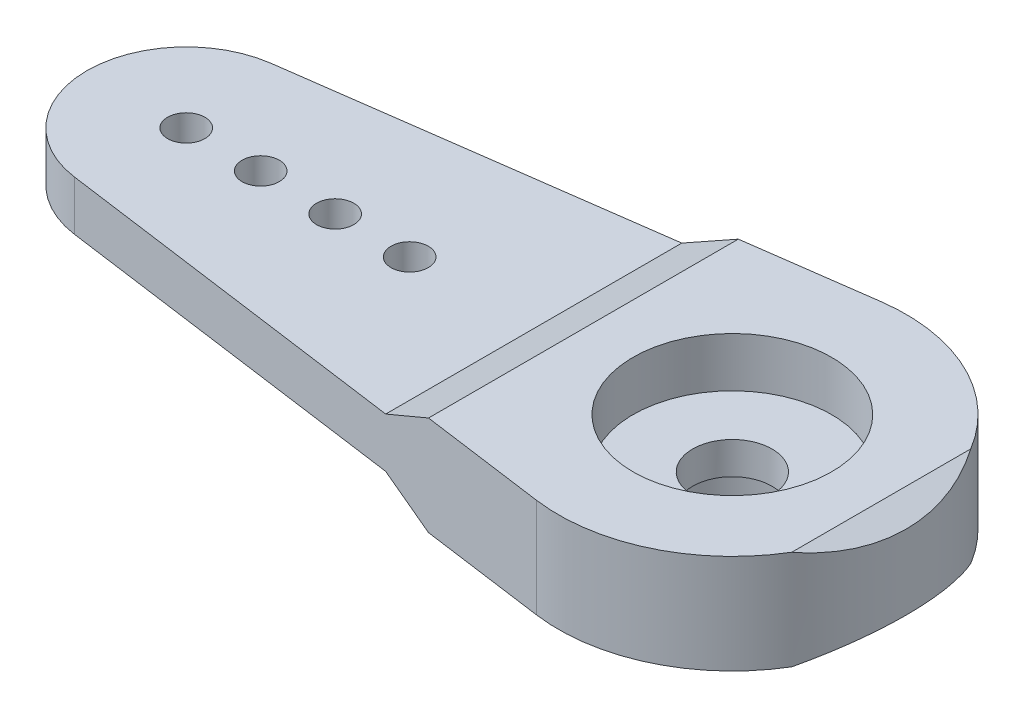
ISO-10303-21;
HEADER;
FILE_DESCRIPTION(('STEP AP214'),'2;1');
FILE_NAME('part.step','',(''),(''),'','','');
FILE_SCHEMA(('AUTOMOTIVE_DESIGN { 1 0 10303 214 1 1 1 1 }'));
ENDSEC;
DATA;
#1=APPLICATION_CONTEXT('core data for automotive mechanical design processes');
#2=APPLICATION_PROTOCOL_DEFINITION('international standard','automotive_design',2000,#1);
#3=PRODUCT_CONTEXT('',#1,'mechanical');
#4=PRODUCT('Part','Part','',(#3));
#5=PRODUCT_RELATED_PRODUCT_CATEGORY('part','',(#4));
#6=PRODUCT_DEFINITION_FORMATION('','',#4);
#7=PRODUCT_DEFINITION_CONTEXT('part definition',#1,'design');
#8=PRODUCT_DEFINITION('design','',#6,#7);
#9=PRODUCT_DEFINITION_SHAPE('','',#8);
#10=(LENGTH_UNIT() NAMED_UNIT(*) SI_UNIT(.MILLI.,.METRE.));
#11=(NAMED_UNIT(*) PLANE_ANGLE_UNIT() SI_UNIT($,.RADIAN.));
#12=(NAMED_UNIT(*) SI_UNIT($,.STERADIAN.) SOLID_ANGLE_UNIT());
#13=UNCERTAINTY_MEASURE_WITH_UNIT(LENGTH_MEASURE(1.E-05),#10,'distance_accuracy_value','');
#14=(GEOMETRIC_REPRESENTATION_CONTEXT(3) GLOBAL_UNCERTAINTY_ASSIGNED_CONTEXT((#13)) GLOBAL_UNIT_ASSIGNED_CONTEXT((#10,
#11,#12)) REPRESENTATION_CONTEXT('',''));
#15=CARTESIAN_POINT('',(0.,0.,0.));
#16=DIRECTION('',(0.,0.,1.));
#17=DIRECTION('',(1.,0.,0.));
#18=AXIS2_PLACEMENT_3D('',#15,#16,#17);
#19=CARTESIAN_POINT('',(-6.,0.,30.));
#20=DIRECTION('',(0.,1.,0.));
#21=DIRECTION('',(0.,0.,1.));
#22=AXIS2_PLACEMENT_3D('',#19,#20,#21);
#23=PLANE('',#22);
#24=DIRECTION('',(-0.990658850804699,0.,0.136363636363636));
#25=VECTOR('',#24,1.);
#26=CARTESIAN_POINT('',(-22.5454545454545,0.,11.0373645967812));
#27=LINE('',#26,#25);
#28=CARTESIAN_POINT('',(-0.954545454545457,0.,8.06538804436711));
#29=VERTEX_POINT('',#28);
#30=CARTESIAN_POINT('',(-5.99999999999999,0.,8.75989203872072));
#31=VERTEX_POINT('',#30);
#32=EDGE_CURVE('E125',#29,#31,#27,.T.);
#33=ORIENTED_EDGE('',*,*,#32,.F.);
#34=CARTESIAN_POINT('',(0.,0.,15.));
#35=DIRECTION('',(0.,1.,0.));
#36=DIRECTION('',(0.,0.,1.));
#37=AXIS2_PLACEMENT_3D('',#34,#35,#36);
#38=CIRCLE('',#37,7.);
#39=CARTESIAN_POINT('',(6.,0.,11.394448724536));
#40=VERTEX_POINT('',#39);
#41=EDGE_CURVE('E111',#40,#29,#38,.T.);
#42=ORIENTED_EDGE('',*,*,#41,.F.);
#43=DIRECTION('',(0.,0.,-1.));
#44=VECTOR('',#43,1.);
#45=CARTESIAN_POINT('',(6.,0.,30.));
#46=LINE('',#45,#44);
#47=CARTESIAN_POINT('',(6.,0.,18.605551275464));
#48=VERTEX_POINT('',#47);
#49=EDGE_CURVE('E181',#48,#40,#46,.T.);
#50=ORIENTED_EDGE('',*,*,#49,.F.);
#51=CARTESIAN_POINT('',(-0.954545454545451,0.,21.9346119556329));
#52=VERTEX_POINT('',#51);
#53=EDGE_CURVE('E51',#52,#48,#38,.T.);
#54=ORIENTED_EDGE('',*,*,#53,.F.);
#55=DIRECTION('',(0.990658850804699,0.,0.136363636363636));
#56=VECTOR('',#55,1.);
#57=CARTESIAN_POINT('',(-0.954545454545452,0.,21.9346119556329));
#58=LINE('',#57,#56);
#59=CARTESIAN_POINT('',(-6.,0.,21.2401079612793));
#60=VERTEX_POINT('',#59);
#61=EDGE_CURVE('E121',#60,#52,#58,.T.);
#62=ORIENTED_EDGE('',*,*,#61,.F.);
#63=DIRECTION('',(0.,0.,-1.));
#64=VECTOR('',#63,1.);
#65=CARTESIAN_POINT('',(-6.,0.,30.));
#66=LINE('',#65,#64);
#67=EDGE_CURVE('E137',#60,#31,#66,.T.);
#68=ORIENTED_EDGE('',*,*,#67,.T.);
#69=EDGE_LOOP('',(#33,#42,#50,#54,#62,#68));
#70=FACE_BOUND('',#69,.T.);
#71=CARTESIAN_POINT('',(0.,0.,15.));
#72=DIRECTION('',(0.,1.,0.));
#73=DIRECTION('',(0.,0.,1.));
#74=AXIS2_PLACEMENT_3D('',#71,#72,#73);
#75=CIRCLE('',#74,5.);
#76=CARTESIAN_POINT('',(0.,0.,20.));
#77=VERTEX_POINT('',#76);
#78=EDGE_CURVE('E11',#77,#77,#75,.F.);
#79=ORIENTED_EDGE('',*,*,#78,.F.);
#80=EDGE_LOOP('',(#79));
#81=FACE_BOUND('',#80,.T.);
#82=ADVANCED_FACE('F34',(#70,#81),#23,.F.);
#83=CARTESIAN_POINT('',(-6.,4.,30.));
#84=DIRECTION('',(0.,-1.,0.));
#85=DIRECTION('',(0.,0.,-1.));
#86=AXIS2_PLACEMENT_3D('',#83,#84,#85);
#87=PLANE('',#86);
#88=CARTESIAN_POINT('',(0.,4.,15.));
#89=DIRECTION('',(0.,1.,0.));
#90=DIRECTION('',(0.,0.,1.));
#91=AXIS2_PLACEMENT_3D('',#88,#89,#90);
#92=CIRCLE('',#91,4.);
#93=CARTESIAN_POINT('',(0.,4.,19.));
#94=VERTEX_POINT('',#93);
#95=EDGE_CURVE('E229',#94,#94,#92,.T.);
#96=ORIENTED_EDGE('',*,*,#95,.F.);
#97=EDGE_LOOP('',(#96));
#98=FACE_BOUND('',#97,.T.);
#99=DIRECTION('',(-0.990658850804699,0.,0.136363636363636));
#100=VECTOR('',#99,1.);
#101=CARTESIAN_POINT('',(-22.5454545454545,4.,11.0373645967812));
#102=LINE('',#101,#100);
#103=CARTESIAN_POINT('',(-0.954545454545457,4.,8.06538804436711));
#104=VERTEX_POINT('',#103);
#105=CARTESIAN_POINT('',(-5.99999999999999,4.,8.75989203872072));
#106=VERTEX_POINT('',#105);
#107=EDGE_CURVE('E128',#104,#106,#102,.T.);
#108=ORIENTED_EDGE('',*,*,#107,.T.);
#109=DIRECTION('',(0.,0.,-1.));
#110=VECTOR('',#109,1.);
#111=CARTESIAN_POINT('',(-6.,4.,30.));
#112=LINE('',#111,#110);
#113=CARTESIAN_POINT('',(-6.,4.,21.2401079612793));
#114=VERTEX_POINT('',#113);
#115=EDGE_CURVE('E175',#114,#106,#112,.T.);
#116=ORIENTED_EDGE('',*,*,#115,.F.);
#117=DIRECTION('',(0.990658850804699,0.,0.136363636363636));
#118=VECTOR('',#117,1.);
#119=CARTESIAN_POINT('',(-0.954545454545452,4.,21.9346119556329));
#120=LINE('',#119,#118);
#121=CARTESIAN_POINT('',(-0.954545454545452,4.,21.9346119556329));
#122=VERTEX_POINT('',#121);
#123=EDGE_CURVE('E144',#114,#122,#120,.T.);
#124=ORIENTED_EDGE('',*,*,#123,.T.);
#125=CARTESIAN_POINT('',(0.,4.,15.));
#126=DIRECTION('',(0.,1.,0.));
#127=DIRECTION('',(0.,0.,1.));
#128=AXIS2_PLACEMENT_3D('',#125,#126,#127);
#129=CIRCLE('',#128,7.);
#130=CARTESIAN_POINT('',(6.,4.,18.605551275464));
#131=VERTEX_POINT('',#130);
#132=EDGE_CURVE('E57',#122,#131,#129,.T.);
#133=ORIENTED_EDGE('',*,*,#132,.T.);
#134=DIRECTION('',(0.,0.,-1.));
#135=VECTOR('',#134,1.);
#136=CARTESIAN_POINT('',(6.,4.,30.));
#137=LINE('',#136,#135);
#138=CARTESIAN_POINT('',(6.,4.,11.394448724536));
#139=VERTEX_POINT('',#138);
#140=EDGE_CURVE('E178',#131,#139,#137,.T.);
#141=ORIENTED_EDGE('',*,*,#140,.T.);
#142=EDGE_CURVE('E147',#139,#104,#129,.T.);
#143=ORIENTED_EDGE('',*,*,#142,.T.);
#144=EDGE_LOOP('',(#108,#116,#124,#133,#141,#143));
#145=FACE_BOUND('',#144,.T.);
#146=ADVANCED_FACE('F255',(#98,#145),#87,.F.);
#147=CARTESIAN_POINT('',(6.,4.,30.));
#148=DIRECTION('',(-0.447213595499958,-0.894427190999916,0.));
#149=DIRECTION('',(0.894427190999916,-0.447213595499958,0.));
#150=AXIS2_PLACEMENT_3D('',#147,#148,#149);
#151=PLANE('',#150);
#152=CARTESIAN_POINT('',(0.,7.,15.));
#153=DIRECTION('',(-0.447213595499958,-0.894427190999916,0.));
#154=DIRECTION('',(-0.894427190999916,0.447213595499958,0.));
#155=AXIS2_PLACEMENT_3D('',#152,#153,#154);
#156=ELLIPSE('',#155,7.82623792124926,7.);
#157=EDGE_CURVE('E162',#139,#131,#156,.T.);
#158=ORIENTED_EDGE('',*,*,#157,.F.);
#159=ORIENTED_EDGE('',*,*,#140,.F.);
#160=EDGE_LOOP('',(#158,#159));
#161=FACE_BOUND('',#160,.T.);
#162=ADVANCED_FACE('F259',(#161),#151,.F.);
#163=CARTESIAN_POINT('',(-30.,3.,30.));
#164=DIRECTION('',(0.,-1.,0.));
#165=DIRECTION('',(0.,0.,-1.));
#166=AXIS2_PLACEMENT_3D('',#163,#164,#165);
#167=PLANE('',#166);
#168=CARTESIAN_POINT('',(-22.,3.,15.));
#169=DIRECTION('',(0.,1.,0.));
#170=DIRECTION('',(0.,0.,1.));
#171=AXIS2_PLACEMENT_3D('',#168,#169,#170);
#172=CIRCLE('',#171,0.750000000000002);
#173=CARTESIAN_POINT('',(-22.,3.,15.75));
#174=VERTEX_POINT('',#173);
#175=EDGE_CURVE('E205',#174,#174,#172,.T.);
#176=ORIENTED_EDGE('',*,*,#175,.F.);
#177=EDGE_LOOP('',(#176));
#178=FACE_BOUND('',#177,.T.);
#179=CARTESIAN_POINT('',(-19.,3.,15.));
#180=DIRECTION('',(0.,1.,0.));
#181=DIRECTION('',(0.,0.,1.));
#182=AXIS2_PLACEMENT_3D('',#179,#180,#181);
#183=CIRCLE('',#182,0.750000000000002);
#184=CARTESIAN_POINT('',(-19.,3.,15.75));
#185=VERTEX_POINT('',#184);
#186=EDGE_CURVE('E202',#185,#185,#183,.T.);
#187=ORIENTED_EDGE('',*,*,#186,.F.);
#188=EDGE_LOOP('',(#187));
#189=FACE_BOUND('',#188,.T.);
#190=CARTESIAN_POINT('',(-16.,3.,15.));
#191=DIRECTION('',(0.,1.,0.));
#192=DIRECTION('',(0.,0.,1.));
#193=AXIS2_PLACEMENT_3D('',#190,#191,#192);
#194=CIRCLE('',#193,0.750000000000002);
#195=CARTESIAN_POINT('',(-16.,3.,15.75));
#196=VERTEX_POINT('',#195);
#197=EDGE_CURVE('E199',#196,#196,#194,.T.);
#198=ORIENTED_EDGE('',*,*,#197,.F.);
#199=EDGE_LOOP('',(#198));
#200=FACE_BOUND('',#199,.T.);
#201=CARTESIAN_POINT('',(-13.,3.,15.));
#202=DIRECTION('',(0.,1.,0.));
#203=DIRECTION('',(0.,0.,1.));
#204=AXIS2_PLACEMENT_3D('',#201,#202,#203);
#205=CIRCLE('',#204,0.75);
#206=CARTESIAN_POINT('',(-13.,3.,15.75));
#207=VERTEX_POINT('',#206);
#208=EDGE_CURVE('E195',#207,#207,#205,.T.);
#209=ORIENTED_EDGE('',*,*,#208,.F.);
#210=EDGE_LOOP('',(#209));
#211=FACE_BOUND('',#210,.T.);
#212=DIRECTION('',(0.990658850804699,0.,-0.136363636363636));
#213=VECTOR('',#212,1.);
#214=CARTESIAN_POINT('',(-32.4230418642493,3.,12.3970089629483));
#215=LINE('',#214,#213);
#216=CARTESIAN_POINT('',(-22.5454545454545,3.,11.0373645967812));
#217=VERTEX_POINT('',#216);
#218=CARTESIAN_POINT('',(-8.,3.,9.03519091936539));
#219=VERTEX_POINT('',#218);
#220=EDGE_CURVE('E169',#217,#219,#215,.T.);
#221=ORIENTED_EDGE('',*,*,#220,.F.);
#222=CARTESIAN_POINT('',(-22.,3.,15.));
#223=DIRECTION('',(0.,-1.,0.));
#224=DIRECTION('',(0.,0.,-1.));
#225=AXIS2_PLACEMENT_3D('',#222,#223,#224);
#226=CIRCLE('',#225,4.00000000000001);
#227=CARTESIAN_POINT('',(-22.5454545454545,3.,18.9626354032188));
#228=VERTEX_POINT('',#227);
#229=EDGE_CURVE('E173',#228,#217,#226,.T.);
#230=ORIENTED_EDGE('',*,*,#229,.F.);
#231=DIRECTION('',(-0.990658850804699,0.,-0.136363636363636));
#232=VECTOR('',#231,1.);
#233=CARTESIAN_POINT('',(-28.3703465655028,3.,18.1608422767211));
#234=LINE('',#233,#232);
#235=CARTESIAN_POINT('',(-8.,3.,20.9648090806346));
#236=VERTEX_POINT('',#235);
#237=EDGE_CURVE('E158',#236,#228,#234,.T.);
#238=ORIENTED_EDGE('',*,*,#237,.F.);
#239=DIRECTION('',(0.,0.,-1.));
#240=VECTOR('',#239,1.);
#241=CARTESIAN_POINT('',(-8.,3.,30.));
#242=LINE('',#241,#240);
#243=EDGE_CURVE('E187',#236,#219,#242,.T.);
#244=ORIENTED_EDGE('',*,*,#243,.T.);
#245=EDGE_LOOP('',(#221,#230,#238,#244));
#246=FACE_BOUND('',#245,.T.);
#247=ADVANCED_FACE('F264',(#178,#189,#200,#211,#246),#167,.F.);
#248=CARTESIAN_POINT('',(-8.,3.,30.));
#249=DIRECTION('',(0.447213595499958,-0.894427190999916,0.));
#250=DIRECTION('',(0.894427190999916,0.447213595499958,0.));
#251=AXIS2_PLACEMENT_3D('',#248,#249,#250);
#252=PLANE('',#251);
#253=DIRECTION('',(0.88772447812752,0.44386223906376,-0.122194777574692));
#254=VECTOR('',#253,1.);
#255=CARTESIAN_POINT('',(-10.2741638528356,1.86291807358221,9.3482283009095));
#256=LINE('',#255,#254);
#257=EDGE_CURVE('E171',#219,#106,#256,.T.);
#258=ORIENTED_EDGE('',*,*,#257,.F.);
#259=ORIENTED_EDGE('',*,*,#243,.F.);
#260=DIRECTION('',(-0.88772447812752,-0.44386223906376,-0.122194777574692));
#261=VECTOR('',#260,1.);
#262=CARTESIAN_POINT('',(-7.01990499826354,3.49004750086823,21.0997186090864));
#263=LINE('',#262,#261);
#264=EDGE_CURVE('E160',#114,#236,#263,.T.);
#265=ORIENTED_EDGE('',*,*,#264,.F.);
#266=ORIENTED_EDGE('',*,*,#115,.T.);
#267=EDGE_LOOP('',(#258,#259,#265,#266));
#268=FACE_BOUND('',#267,.T.);
#269=ADVANCED_FACE('F36',(#268),#252,.F.);
#270=CARTESIAN_POINT('',(-22.,0.,15.));
#271=DIRECTION('',(0.,1.,0.));
#272=DIRECTION('',(0.,0.,1.));
#273=AXIS2_PLACEMENT_3D('',#270,#271,#272);
#274=CYLINDRICAL_SURFACE('',#273,4.00000000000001);
#275=ORIENTED_EDGE('',*,*,#229,.T.);
#276=DIRECTION('',(0.,1.,0.));
#277=VECTOR('',#276,1.);
#278=CARTESIAN_POINT('',(-22.5454545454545,0.,11.0373645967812));
#279=LINE('',#278,#277);
#280=CARTESIAN_POINT('',(-22.5454545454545,1.,11.0373645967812));
#281=VERTEX_POINT('',#280);
#282=EDGE_CURVE('E130',#281,#217,#279,.T.);
#283=ORIENTED_EDGE('',*,*,#282,.F.);
#284=CARTESIAN_POINT('',(-22.,1.,15.));
#285=DIRECTION('',(0.,1.,0.));
#286=DIRECTION('',(0.,0.,1.));
#287=AXIS2_PLACEMENT_3D('',#284,#285,#286);
#288=CIRCLE('',#287,4.00000000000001);
#289=CARTESIAN_POINT('',(-22.5454545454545,1.,18.9626354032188));
#290=VERTEX_POINT('',#289);
#291=EDGE_CURVE('E43',#281,#290,#288,.T.);
#292=ORIENTED_EDGE('',*,*,#291,.T.);
#293=DIRECTION('',(0.,1.,0.));
#294=VECTOR('',#293,1.);
#295=CARTESIAN_POINT('',(-22.5454545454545,0.,18.9626354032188));
#296=LINE('',#295,#294);
#297=EDGE_CURVE('E138',#290,#228,#296,.T.);
#298=ORIENTED_EDGE('',*,*,#297,.T.);
#299=EDGE_LOOP('',(#275,#283,#292,#298));
#300=FACE_BOUND('',#299,.T.);
#301=ADVANCED_FACE('F271',(#300),#274,.T.);
#302=CARTESIAN_POINT('',(-22.5454545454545,0.,11.0373645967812));
#303=DIRECTION('',(-0.136363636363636,0.,-0.990658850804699));
#304=DIRECTION('',(-0.990658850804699,0.,0.136363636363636));
#305=AXIS2_PLACEMENT_3D('',#302,#303,#304);
#306=PLANE('',#305);
#307=ORIENTED_EDGE('',*,*,#257,.T.);
#308=ORIENTED_EDGE('',*,*,#107,.F.);
#309=DIRECTION('',(0.,1.,0.));
#310=VECTOR('',#309,1.);
#311=CARTESIAN_POINT('',(-0.954545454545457,0.,8.06538804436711));
#312=LINE('',#311,#310);
#313=EDGE_CURVE('E114',#29,#104,#312,.T.);
#314=ORIENTED_EDGE('',*,*,#313,.F.);
#315=ORIENTED_EDGE('',*,*,#32,.T.);
#316=DIRECTION('',(-0.88772447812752,0.44386223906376,0.122194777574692));
#317=VECTOR('',#316,1.);
#318=CARTESIAN_POINT('',(-8.30402698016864,1.15201349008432,9.0770400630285));
#319=LINE('',#318,#317);
#320=CARTESIAN_POINT('',(-8.,1.,9.0351909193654));
#321=VERTEX_POINT('',#320);
#322=EDGE_CURVE('E165',#31,#321,#319,.T.);
#323=ORIENTED_EDGE('',*,*,#322,.T.);
#324=DIRECTION('',(-0.990658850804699,0.,0.136363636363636));
#325=VECTOR('',#324,1.);
#326=CARTESIAN_POINT('',(-32.4230418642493,1.,12.3970089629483));
#327=LINE('',#326,#325);
#328=EDGE_CURVE('E167',#321,#281,#327,.T.);
#329=ORIENTED_EDGE('',*,*,#328,.T.);
#330=ORIENTED_EDGE('',*,*,#282,.T.);
#331=ORIENTED_EDGE('',*,*,#220,.T.);
#332=EDGE_LOOP('',(#307,#308,#314,#315,#323,#329,#330,#331));
#333=FACE_BOUND('',#332,.T.);
#334=ADVANCED_FACE('F124',(#333),#306,.T.);
#335=CARTESIAN_POINT('',(0.,0.,15.));
#336=DIRECTION('',(0.,1.,0.));
#337=DIRECTION('',(0.,0.,1.));
#338=AXIS2_PLACEMENT_3D('',#335,#336,#337);
#339=CYLINDRICAL_SURFACE('',#338,7.);
#340=CARTESIAN_POINT('',(0.,-3.00000000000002,15.));
#341=DIRECTION('',(-0.44721359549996,0.894427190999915,0.));
#342=DIRECTION('',(0.894427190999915,0.44721359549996,0.));
#343=AXIS2_PLACEMENT_3D('',#340,#341,#342);
#344=ELLIPSE('',#343,7.82623792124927,7.);
#345=EDGE_CURVE('E116',#48,#40,#344,.T.);
#346=ORIENTED_EDGE('',*,*,#345,.T.);
#347=ORIENTED_EDGE('',*,*,#41,.T.);
#348=ORIENTED_EDGE('',*,*,#313,.T.);
#349=ORIENTED_EDGE('',*,*,#142,.F.);
#350=ORIENTED_EDGE('',*,*,#157,.T.);
#351=ORIENTED_EDGE('',*,*,#132,.F.);
#352=DIRECTION('',(0.,1.,0.));
#353=VECTOR('',#352,1.);
#354=CARTESIAN_POINT('',(-0.954545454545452,0.,21.9346119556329));
#355=LINE('',#354,#353);
#356=EDGE_CURVE('E131',#52,#122,#355,.T.);
#357=ORIENTED_EDGE('',*,*,#356,.F.);
#358=ORIENTED_EDGE('',*,*,#53,.T.);
#359=EDGE_LOOP('',(#346,#347,#348,#349,#350,#351,#357,#358));
#360=FACE_BOUND('',#359,.T.);
#361=ADVANCED_FACE('F113',(#360),#339,.T.);
#362=CARTESIAN_POINT('',(-0.954545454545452,0.,21.9346119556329));
#363=DIRECTION('',(-0.136363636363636,0.,0.990658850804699));
#364=DIRECTION('',(0.990658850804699,0.,0.136363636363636));
#365=AXIS2_PLACEMENT_3D('',#362,#363,#364);
#366=PLANE('',#365);
#367=ORIENTED_EDGE('',*,*,#264,.T.);
#368=ORIENTED_EDGE('',*,*,#237,.T.);
#369=ORIENTED_EDGE('',*,*,#297,.F.);
#370=DIRECTION('',(0.990658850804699,0.,0.136363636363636));
#371=VECTOR('',#370,1.);
#372=CARTESIAN_POINT('',(-28.3703465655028,1.,18.1608422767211));
#373=LINE('',#372,#371);
#374=CARTESIAN_POINT('',(-8.,1.,20.9648090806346));
#375=VERTEX_POINT('',#374);
#376=EDGE_CURVE('E156',#290,#375,#373,.T.);
#377=ORIENTED_EDGE('',*,*,#376,.T.);
#378=DIRECTION('',(0.88772447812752,-0.44386223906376,0.122194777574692));
#379=VECTOR('',#378,1.);
#380=CARTESIAN_POINT('',(-5.0497681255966,-0.4751159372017,21.3709068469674));
#381=LINE('',#380,#379);
#382=EDGE_CURVE('E152',#375,#60,#381,.T.);
#383=ORIENTED_EDGE('',*,*,#382,.T.);
#384=ORIENTED_EDGE('',*,*,#61,.T.);
#385=ORIENTED_EDGE('',*,*,#356,.T.);
#386=ORIENTED_EDGE('',*,*,#123,.F.);
#387=EDGE_LOOP('',(#367,#368,#369,#377,#383,#384,#385,#386));
#388=FACE_BOUND('',#387,.T.);
#389=ADVANCED_FACE('F234',(#388),#366,.T.);
#390=CARTESIAN_POINT('',(-30.,1.,30.));
#391=DIRECTION('',(0.,1.,0.));
#392=DIRECTION('',(0.,0.,1.));
#393=AXIS2_PLACEMENT_3D('',#390,#391,#392);
#394=PLANE('',#393);
#395=CARTESIAN_POINT('',(-22.,1.,15.));
#396=DIRECTION('',(0.,1.,0.));
#397=DIRECTION('',(0.,0.,1.));
#398=AXIS2_PLACEMENT_3D('',#395,#396,#397);
#399=CIRCLE('',#398,0.750000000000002);
#400=CARTESIAN_POINT('',(-22.,1.,15.75));
#401=VERTEX_POINT('',#400);
#402=EDGE_CURVE('E203',#401,#401,#399,.T.);
#403=ORIENTED_EDGE('',*,*,#402,.T.);
#404=EDGE_LOOP('',(#403));
#405=FACE_BOUND('',#404,.T.);
#406=CARTESIAN_POINT('',(-19.,1.,15.));
#407=DIRECTION('',(0.,1.,0.));
#408=DIRECTION('',(0.,0.,1.));
#409=AXIS2_PLACEMENT_3D('',#406,#407,#408);
#410=CIRCLE('',#409,0.750000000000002);
#411=CARTESIAN_POINT('',(-19.,1.,15.75));
#412=VERTEX_POINT('',#411);
#413=EDGE_CURVE('E200',#412,#412,#410,.T.);
#414=ORIENTED_EDGE('',*,*,#413,.T.);
#415=EDGE_LOOP('',(#414));
#416=FACE_BOUND('',#415,.T.);
#417=CARTESIAN_POINT('',(-16.,1.,15.));
#418=DIRECTION('',(0.,1.,0.));
#419=DIRECTION('',(0.,0.,1.));
#420=AXIS2_PLACEMENT_3D('',#417,#418,#419);
#421=CIRCLE('',#420,0.750000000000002);
#422=CARTESIAN_POINT('',(-16.,1.,15.75));
#423=VERTEX_POINT('',#422);
#424=EDGE_CURVE('E196',#423,#423,#421,.T.);
#425=ORIENTED_EDGE('',*,*,#424,.T.);
#426=EDGE_LOOP('',(#425));
#427=FACE_BOUND('',#426,.T.);
#428=CARTESIAN_POINT('',(-13.,1.,15.));
#429=DIRECTION('',(0.,1.,0.));
#430=DIRECTION('',(0.,0.,1.));
#431=AXIS2_PLACEMENT_3D('',#428,#429,#430);
#432=CIRCLE('',#431,0.75);
#433=CARTESIAN_POINT('',(-13.,1.,15.75));
#434=VERTEX_POINT('',#433);
#435=EDGE_CURVE('E191',#434,#434,#432,.T.);
#436=ORIENTED_EDGE('',*,*,#435,.T.);
#437=EDGE_LOOP('',(#436));
#438=FACE_BOUND('',#437,.T.);
#439=ORIENTED_EDGE('',*,*,#328,.F.);
#440=DIRECTION('',(0.,0.,-1.));
#441=VECTOR('',#440,1.);
#442=CARTESIAN_POINT('',(-8.,1.,30.));
#443=LINE('',#442,#441);
#444=EDGE_CURVE('E184',#375,#321,#443,.T.);
#445=ORIENTED_EDGE('',*,*,#444,.F.);
#446=ORIENTED_EDGE('',*,*,#376,.F.);
#447=ORIENTED_EDGE('',*,*,#291,.F.);
#448=EDGE_LOOP('',(#439,#445,#446,#447));
#449=FACE_BOUND('',#448,.T.);
#450=ADVANCED_FACE('F249',(#405,#416,#427,#438,#449),#394,.F.);
#451=CARTESIAN_POINT('',(-6.,0.,30.));
#452=DIRECTION('',(0.447213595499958,0.894427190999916,0.));
#453=DIRECTION('',(-0.894427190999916,0.447213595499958,0.));
#454=AXIS2_PLACEMENT_3D('',#451,#452,#453);
#455=PLANE('',#454);
#456=ORIENTED_EDGE('',*,*,#322,.F.);
#457=ORIENTED_EDGE('',*,*,#67,.F.);
#458=ORIENTED_EDGE('',*,*,#382,.F.);
#459=ORIENTED_EDGE('',*,*,#444,.T.);
#460=EDGE_LOOP('',(#456,#457,#458,#459));
#461=FACE_BOUND('',#460,.T.);
#462=ADVANCED_FACE('F240',(#461),#455,.F.);
#463=CARTESIAN_POINT('',(8.,1.,30.));
#464=DIRECTION('',(-0.44721359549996,0.894427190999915,0.));
#465=DIRECTION('',(-0.894427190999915,-0.44721359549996,0.));
#466=AXIS2_PLACEMENT_3D('',#463,#464,#465);
#467=PLANE('',#466);
#468=ORIENTED_EDGE('',*,*,#345,.F.);
#469=ORIENTED_EDGE('',*,*,#49,.T.);
#470=EDGE_LOOP('',(#468,#469));
#471=FACE_BOUND('',#470,.T.);
#472=ADVANCED_FACE('F237',(#471),#467,.F.);
#473=CARTESIAN_POINT('',(0.,2.,15.));
#474=DIRECTION('',(0.,1.,0.));
#475=DIRECTION('',(0.,0.,1.));
#476=AXIS2_PLACEMENT_3D('',#473,#474,#475);
#477=CYLINDRICAL_SURFACE('',#476,4.);
#478=CARTESIAN_POINT('',(0.,2.,15.));
#479=DIRECTION('',(0.,1.,0.));
#480=DIRECTION('',(0.,0.,1.));
#481=AXIS2_PLACEMENT_3D('',#478,#479,#480);
#482=CIRCLE('',#481,4.);
#483=CARTESIAN_POINT('',(0.,2.,19.));
#484=VERTEX_POINT('',#483);
#485=EDGE_CURVE('E148',#484,#484,#482,.T.);
#486=ORIENTED_EDGE('',*,*,#485,.F.);
#487=EDGE_LOOP('',(#486));
#488=FACE_BOUND('',#487,.T.);
#489=ORIENTED_EDGE('',*,*,#95,.T.);
#490=EDGE_LOOP('',(#489));
#491=FACE_BOUND('',#490,.T.);
#492=ADVANCED_FACE('F239',(#488,#491),#477,.F.);
#493=CARTESIAN_POINT('',(0.,2.,15.));
#494=DIRECTION('',(0.,1.,0.));
#495=DIRECTION('',(0.,0.,1.));
#496=AXIS2_PLACEMENT_3D('',#493,#494,#495);
#497=PLANE('',#496);
#498=CARTESIAN_POINT('',(0.,2.,15.));
#499=DIRECTION('',(0.,1.,0.));
#500=DIRECTION('',(0.,0.,1.));
#501=AXIS2_PLACEMENT_3D('',#498,#499,#500);
#502=CIRCLE('',#501,1.6);
#503=CARTESIAN_POINT('',(0.,2.,16.6));
#504=VERTEX_POINT('',#503);
#505=EDGE_CURVE('E358',#504,#504,#502,.T.);
#506=ORIENTED_EDGE('',*,*,#505,.F.);
#507=EDGE_LOOP('',(#506));
#508=FACE_BOUND('',#507,.T.);
#509=ORIENTED_EDGE('',*,*,#485,.T.);
#510=EDGE_LOOP('',(#509));
#511=FACE_BOUND('',#510,.T.);
#512=ADVANCED_FACE('F246',(#508,#511),#497,.T.);
#513=CARTESIAN_POINT('',(0.,-0.5,15.));
#514=DIRECTION('',(0.,1.,0.));
#515=DIRECTION('',(0.,0.,1.));
#516=AXIS2_PLACEMENT_3D('',#513,#514,#515);
#517=CYLINDRICAL_SURFACE('',#516,5.);
#518=CARTESIAN_POINT('',(0.,-0.5,15.));
#519=DIRECTION('',(0.,-1.,0.));
#520=DIRECTION('',(0.,0.,-1.));
#521=AXIS2_PLACEMENT_3D('',#518,#519,#520);
#522=CIRCLE('',#521,5.);
#523=CARTESIAN_POINT('',(0.,-0.5,10.));
#524=VERTEX_POINT('',#523);
#525=EDGE_CURVE('E226',#524,#524,#522,.T.);
#526=ORIENTED_EDGE('',*,*,#525,.F.);
#527=EDGE_LOOP('',(#526));
#528=FACE_BOUND('',#527,.T.);
#529=ORIENTED_EDGE('',*,*,#78,.T.);
#530=EDGE_LOOP('',(#529));
#531=FACE_BOUND('',#530,.T.);
#532=ADVANCED_FACE('F312',(#528,#531),#517,.T.);
#533=CARTESIAN_POINT('',(0.,-0.5,15.));
#534=DIRECTION('',(0.,1.,0.));
#535=DIRECTION('',(0.,0.,-1.));
#536=AXIS2_PLACEMENT_3D('',#533,#534,#535);
#537=CONICAL_SURFACE('',#536,5.,0.78539816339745);
#538=CARTESIAN_POINT('',(0.,-2.,15.));
#539=DIRECTION('',(0.,-1.,0.));
#540=DIRECTION('',(0.,0.,-1.));
#541=AXIS2_PLACEMENT_3D('',#538,#539,#540);
#542=CIRCLE('',#541,3.5);
#543=CARTESIAN_POINT('',(0.,-2.,11.5));
#544=VERTEX_POINT('',#543);
#545=EDGE_CURVE('E194',#544,#544,#542,.T.);
#546=ORIENTED_EDGE('',*,*,#545,.F.);
#547=EDGE_LOOP('',(#546));
#548=FACE_BOUND('',#547,.T.);
#549=ORIENTED_EDGE('',*,*,#525,.T.);
#550=EDGE_LOOP('',(#549));
#551=FACE_BOUND('',#550,.T.);
#552=ADVANCED_FACE('F316',(#548,#551),#537,.T.);
#553=CARTESIAN_POINT('',(0.,-2.,15.));
#554=DIRECTION('',(0.,-1.,0.));
#555=DIRECTION('',(0.,0.,-1.));
#556=AXIS2_PLACEMENT_3D('',#553,#554,#555);
#557=PLANE('',#556);
#558=CARTESIAN_POINT('',(0.,-2.,15.));
#559=DIRECTION('',(0.,-1.,0.));
#560=DIRECTION('',(0.,0.,-1.));
#561=AXIS2_PLACEMENT_3D('',#558,#559,#560);
#562=CIRCLE('',#561,2.9);
#563=CARTESIAN_POINT('',(0.,-2.,12.1));
#564=VERTEX_POINT('',#563);
#565=EDGE_CURVE('E216',#564,#564,#562,.T.);
#566=ORIENTED_EDGE('',*,*,#565,.F.);
#567=EDGE_LOOP('',(#566));
#568=FACE_BOUND('',#567,.T.);
#569=ORIENTED_EDGE('',*,*,#545,.T.);
#570=EDGE_LOOP('',(#569));
#571=FACE_BOUND('',#570,.T.);
#572=ADVANCED_FACE('F320',(#568,#571),#557,.T.);
#573=CARTESIAN_POINT('',(-13.,-2.,15.));
#574=DIRECTION('',(0.,1.,0.));
#575=DIRECTION('',(0.,0.,1.));
#576=AXIS2_PLACEMENT_3D('',#573,#574,#575);
#577=CYLINDRICAL_SURFACE('',#576,0.75);
#578=ORIENTED_EDGE('',*,*,#208,.T.);
#579=EDGE_LOOP('',(#578));
#580=FACE_BOUND('',#579,.T.);
#581=ORIENTED_EDGE('',*,*,#435,.F.);
#582=EDGE_LOOP('',(#581));
#583=FACE_BOUND('',#582,.T.);
#584=ADVANCED_FACE('F324',(#580,#583),#577,.F.);
#585=CARTESIAN_POINT('',(-16.,-2.,15.));
#586=DIRECTION('',(0.,1.,0.));
#587=DIRECTION('',(0.,0.,1.));
#588=AXIS2_PLACEMENT_3D('',#585,#586,#587);
#589=CYLINDRICAL_SURFACE('',#588,0.750000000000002);
#590=ORIENTED_EDGE('',*,*,#197,.T.);
#591=EDGE_LOOP('',(#590));
#592=FACE_BOUND('',#591,.T.);
#593=ORIENTED_EDGE('',*,*,#424,.F.);
#594=EDGE_LOOP('',(#593));
#595=FACE_BOUND('',#594,.T.);
#596=ADVANCED_FACE('F328',(#592,#595),#589,.F.);
#597=CARTESIAN_POINT('',(-19.,-2.,15.));
#598=DIRECTION('',(0.,1.,0.));
#599=DIRECTION('',(0.,0.,1.));
#600=AXIS2_PLACEMENT_3D('',#597,#598,#599);
#601=CYLINDRICAL_SURFACE('',#600,0.750000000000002);
#602=ORIENTED_EDGE('',*,*,#186,.T.);
#603=EDGE_LOOP('',(#602));
#604=FACE_BOUND('',#603,.T.);
#605=ORIENTED_EDGE('',*,*,#413,.F.);
#606=EDGE_LOOP('',(#605));
#607=FACE_BOUND('',#606,.T.);
#608=ADVANCED_FACE('F332',(#604,#607),#601,.F.);
#609=CARTESIAN_POINT('',(-22.,-2.,15.));
#610=DIRECTION('',(0.,1.,0.));
#611=DIRECTION('',(0.,0.,1.));
#612=AXIS2_PLACEMENT_3D('',#609,#610,#611);
#613=CYLINDRICAL_SURFACE('',#612,0.750000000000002);
#614=ORIENTED_EDGE('',*,*,#175,.T.);
#615=EDGE_LOOP('',(#614));
#616=FACE_BOUND('',#615,.T.);
#617=ORIENTED_EDGE('',*,*,#402,.F.);
#618=EDGE_LOOP('',(#617));
#619=FACE_BOUND('',#618,.T.);
#620=ADVANCED_FACE('F336',(#616,#619),#613,.F.);
#621=CARTESIAN_POINT('',(0.,0.7,15.));
#622=DIRECTION('',(0.,-1.,0.));
#623=DIRECTION('',(0.,0.,-1.));
#624=AXIS2_PLACEMENT_3D('',#621,#622,#623);
#625=CYLINDRICAL_SURFACE('',#624,2.9);
#626=CARTESIAN_POINT('',(0.,0.7,15.));
#627=DIRECTION('',(0.,-1.,0.));
#628=DIRECTION('',(0.,0.,-1.));
#629=AXIS2_PLACEMENT_3D('',#626,#627,#628);
#630=CIRCLE('',#629,2.9);
#631=CARTESIAN_POINT('',(0.,0.7,12.1));
#632=VERTEX_POINT('',#631);
#633=EDGE_CURVE('E211',#632,#632,#630,.T.);
#634=CARTESIAN_POINT('',(0.,0.7,12.1));
#635=CARTESIAN_POINT('',(0.,0.671875,12.1));
#636=CARTESIAN_POINT('',(0.,0.64375,12.1));
#637=CARTESIAN_POINT('',(0.,0.5875,12.1));
#638=CARTESIAN_POINT('',(0.,0.559375,12.1));
#639=CARTESIAN_POINT('',(0.,0.503125,12.1));
#640=CARTESIAN_POINT('',(0.,0.475,12.1));
#641=CARTESIAN_POINT('',(0.,0.41875,12.1));
#642=CARTESIAN_POINT('',(0.,0.390625,12.1));
#643=CARTESIAN_POINT('',(0.,0.334375,12.1));
#644=CARTESIAN_POINT('',(0.,0.30625,12.1));
#645=CARTESIAN_POINT('',(0.,0.25,12.1));
#646=CARTESIAN_POINT('',(0.,0.221875,12.1));
#647=CARTESIAN_POINT('',(0.,0.165625,12.1));
#648=CARTESIAN_POINT('',(0.,0.1375,12.1));
#649=CARTESIAN_POINT('',(0.,0.0812500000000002,12.1));
#650=CARTESIAN_POINT('',(0.,0.0531250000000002,12.1));
#651=CARTESIAN_POINT('',(0.,-0.00312499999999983,12.1));
#652=CARTESIAN_POINT('',(0.,-0.0312499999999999,12.1));
#653=CARTESIAN_POINT('',(0.,-0.0874999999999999,12.1));
#654=CARTESIAN_POINT('',(0.,-0.115625,12.1));
#655=CARTESIAN_POINT('',(0.,-0.171875,12.1));
#656=CARTESIAN_POINT('',(0.,-0.2,12.1));
#657=CARTESIAN_POINT('',(0.,-0.25625,12.1));
#658=CARTESIAN_POINT('',(0.,-0.284375,12.1));
#659=CARTESIAN_POINT('',(0.,-0.340625,12.1));
#660=CARTESIAN_POINT('',(0.,-0.36875,12.1));
#661=CARTESIAN_POINT('',(0.,-0.425,12.1));
#662=CARTESIAN_POINT('',(0.,-0.453125,12.1));
#663=CARTESIAN_POINT('',(0.,-0.509375,12.1));
#664=CARTESIAN_POINT('',(0.,-0.5375,12.1));
#665=CARTESIAN_POINT('',(0.,-0.59375,12.1));
#666=CARTESIAN_POINT('',(0.,-0.621875,12.1));
#667=CARTESIAN_POINT('',(0.,-0.678125,12.1));
#668=CARTESIAN_POINT('',(0.,-0.70625,12.1));
#669=CARTESIAN_POINT('',(0.,-0.7625,12.1));
#670=CARTESIAN_POINT('',(0.,-0.790625,12.1));
#671=CARTESIAN_POINT('',(0.,-0.846875,12.1));
#672=CARTESIAN_POINT('',(0.,-0.875,12.1));
#673=CARTESIAN_POINT('',(0.,-0.93125,12.1));
#674=CARTESIAN_POINT('',(0.,-0.959375,12.1));
#675=CARTESIAN_POINT('',(0.,-1.015625,12.1));
#676=CARTESIAN_POINT('',(0.,-1.04375,12.1));
#677=CARTESIAN_POINT('',(0.,-1.1,12.1));
#678=CARTESIAN_POINT('',(0.,-1.128125,12.1));
#679=CARTESIAN_POINT('',(0.,-1.184375,12.1));
#680=CARTESIAN_POINT('',(0.,-1.2125,12.1));
#681=CARTESIAN_POINT('',(0.,-1.26875,12.1));
#682=CARTESIAN_POINT('',(0.,-1.296875,12.1));
#683=CARTESIAN_POINT('',(0.,-1.353125,12.1));
#684=CARTESIAN_POINT('',(0.,-1.38125,12.1));
#685=CARTESIAN_POINT('',(0.,-1.4375,12.1));
#686=CARTESIAN_POINT('',(0.,-1.465625,12.1));
#687=CARTESIAN_POINT('',(0.,-1.521875,12.1));
#688=CARTESIAN_POINT('',(0.,-1.55,12.1));
#689=CARTESIAN_POINT('',(0.,-1.60625,12.1));
#690=CARTESIAN_POINT('',(0.,-1.634375,12.1));
#691=CARTESIAN_POINT('',(0.,-1.690625,12.1));
#692=CARTESIAN_POINT('',(0.,-1.71875,12.1));
#693=CARTESIAN_POINT('',(0.,-1.775,12.1));
#694=CARTESIAN_POINT('',(0.,-1.803125,12.1));
#695=CARTESIAN_POINT('',(0.,-1.859375,12.1));
#696=CARTESIAN_POINT('',(0.,-1.8875,12.1));
#697=CARTESIAN_POINT('',(0.,-1.94375,12.1));
#698=CARTESIAN_POINT('',(0.,-1.971875,12.1));
#699=CARTESIAN_POINT('',(0.,-2.,12.1));
#700=B_SPLINE_CURVE_WITH_KNOTS('',3,(#634,#635,#636,#637,#638,#639,#640,#641,#642,#643,#644,
#645,#646,#647,#648,#649,#650,#651,#652,#653,#654,#655,#656,#657,#658,#659,#660,#661,#662,#663,
#664,#665,#666,#667,#668,#669,#670,#671,#672,#673,#674,#675,#676,#677,#678,#679,#680,#681,#682,
#683,#684,#685,#686,#687,#688,#689,#690,#691,#692,#693,#694,#695,#696,#697,#698,#699),
.UNSPECIFIED.,.F.,.F.,(4,2,2,2,2,2,2,2,2,2,2,2,2,2,2,2,2,2,2,2,2,2,2,2,2,2,2,2,2,2,2,2,4),(0.,
0.0843749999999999,0.16875,0.253125,0.3375,0.421875,0.50625,0.590625,0.675,0.759375,0.84375,
0.928125,1.0125,1.096875,1.18125,1.265625,1.35,1.434375,1.51875,1.603125,1.6875,1.771875,
1.85625,1.940625,2.025,2.109375,2.19375,2.278125,2.3625,2.446875,2.53125,2.615625,2.7),.UNSPECIFIED.);
#701=EDGE_CURVE('BSEAM340',#632,#564,#700,.T.);
#702=ORIENTED_EDGE('',*,*,#633,.F.);
#703=ORIENTED_EDGE('',*,*,#565,.T.);
#704=ORIENTED_EDGE('',*,*,#701,.T.);
#705=ORIENTED_EDGE('',*,*,#701,.F.);
#706=EDGE_LOOP('',(#702,#704,#703,#705));
#707=FACE_BOUND('',#706,.T.);
#708=ADVANCED_FACE('F340',(#707),#625,.F.);
#709=CARTESIAN_POINT('',(0.,0.7,15.));
#710=DIRECTION('',(0.,-1.,0.));
#711=DIRECTION('',(0.,0.,-1.));
#712=AXIS2_PLACEMENT_3D('',#709,#710,#711);
#713=PLANE('',#712);
#714=CARTESIAN_POINT('',(0.,0.7,15.));
#715=DIRECTION('',(0.,-1.,0.));
#716=DIRECTION('',(0.,0.,-1.));
#717=AXIS2_PLACEMENT_3D('',#714,#715,#716);
#718=CIRCLE('',#717,1.6);
#719=CARTESIAN_POINT('',(0.,0.7,13.4));
#720=VERTEX_POINT('',#719);
#721=EDGE_CURVE('E38',#720,#720,#718,.T.);
#722=ORIENTED_EDGE('',*,*,#721,.F.);
#723=EDGE_LOOP('',(#722));
#724=FACE_BOUND('',#723,.T.);
#725=ORIENTED_EDGE('',*,*,#633,.T.);
#726=EDGE_LOOP('',(#725));
#727=FACE_BOUND('',#726,.T.);
#728=ADVANCED_FACE('F343',(#724,#727),#713,.T.);
#729=CARTESIAN_POINT('',(0.,-2.,15.));
#730=DIRECTION('',(0.,1.,0.));
#731=DIRECTION('',(0.,0.,1.));
#732=AXIS2_PLACEMENT_3D('',#729,#730,#731);
#733=CYLINDRICAL_SURFACE('',#732,1.6);
#734=ORIENTED_EDGE('',*,*,#721,.T.);
#735=EDGE_LOOP('',(#734));
#736=FACE_BOUND('',#735,.T.);
#737=ORIENTED_EDGE('',*,*,#505,.T.);
#738=EDGE_LOOP('',(#737));
#739=FACE_BOUND('',#738,.T.);
#740=ADVANCED_FACE('F347',(#736,#739),#733,.F.);
#741=CLOSED_SHELL('',(#82,#146,#162,#247,#269,#301,#334,#361,#389,#450,#462,#472,#492,#512,#532,
#552,#572,#584,#596,#608,#620,#708,#728,#740));
#742=MANIFOLD_SOLID_BREP('B2',#741);
#743=ADVANCED_BREP_SHAPE_REPRESENTATION('',(#18,#742),#14);
#744=SHAPE_DEFINITION_REPRESENTATION(#9,#743);
ENDSEC;
END-ISO-10303-21;
